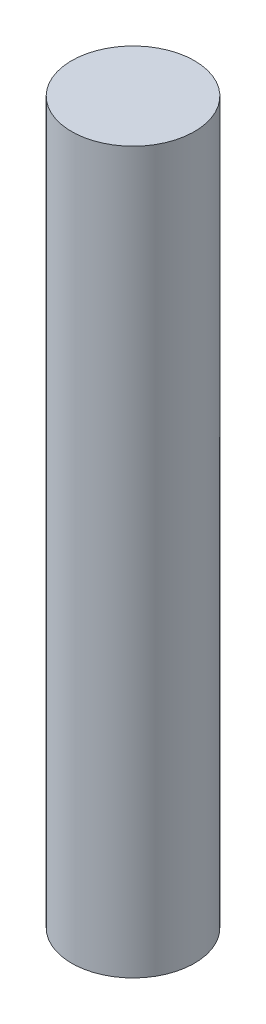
from build123d import *

# Parameters (mm, degrees)
CROQUIS3_W = 1.5
CROQUIS3_H = 17.59


with BuildPart() as part:
    # Croquis3 → Revoluci_n2 (revolve)
    with BuildSketch(Plane.XY, mode=Mode.PRIVATE) as revoluci_n2_sk:
        with Locations((0.75, 8.795)):
            Rectangle(CROQUIS3_W, CROQUIS3_H)
    revolve(revoluci_n2_sk.sketch.rotate(Axis((0, 0, 0), (0, 1, 0)), 90), axis=Axis((0, 0, 0), (0, 1, 0)))


solid = part.part
